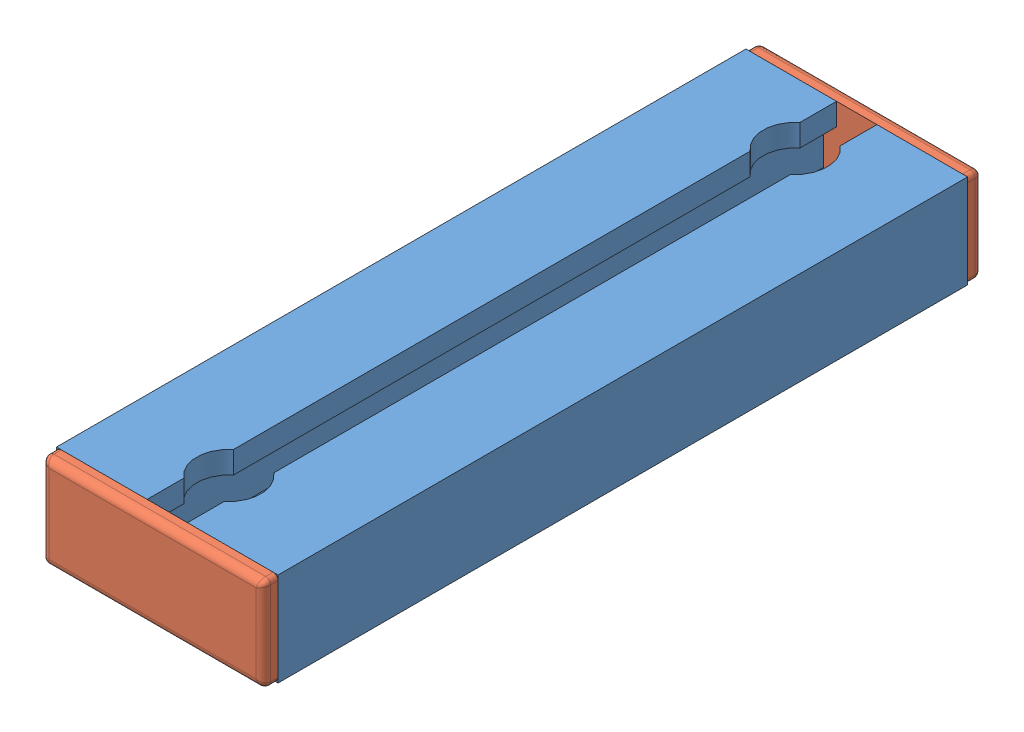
SolidWorks assembly 21.1730 FLOOR MOUNTING PLATE 45.SLDASM, configuration Default (file format 3800). Lengths in mm.
Overall size (45.01 19.01 146.01).
3 component instances, 2 part files, 6 mates.
Components (placement in the parent):
- 21.1730 FLOOR MOUNTING PLATE 45-1: 21.1730 FLOOR MOUNTING PLATE 45.SLDPRT [Default] at origin size (45 19 140)
- 22.1063_1 END CAP 45X19 GRAY-1: 22.1063_1 END CAP 45X19 GRAY.SLDPRT [Default] at (0 0 73) x (0 -1 0) z (0 0 -1) size (19.01 45.01 3)
- 22.1063_1 END CAP 45X19 GRAY-2: 22.1063_1 END CAP 45X19 GRAY.SLDPRT [Default] at (0 0 -73) x (0 1 0) z (0 0 1) size (19.01 45.01 3)
Mates (geometry in assembly coordinates):
- Coincident1: coincident: plane of 22.1063_1 END CAP 45X19 GRAY-1 through (0 0 70) normal (0 0 -1); plane of 21.1730 FLOOR MOUNTING PLATE 45-1 through (-22.5 9.5 70) normal (0 0 1)
- Coincident2: coincident: plane of 21.1730 FLOOR MOUNTING PLATE 45-1 through (-4.1 9.5 -70) normal (0 1 0); plane of 22.1063_1 END CAP 45X19 GRAY-1 through (22.5 9.5 73) normal (0 1 0)
- Coincident3: coincident aligned: plane of 21.1730 FLOOR MOUNTING PLATE 45-1 through (22.5 -9.5 -70) normal (1 0 0); plane of 22.1063_1 END CAP 45X19 GRAY-1 through (22.5 -9.5 73) normal (1 0 0)
- Coincident4: coincident: plane of 21.1730 FLOOR MOUNTING PLATE 45-1 through (-22.5 9.5 -70) normal (0 0 -1); plane of ? through (12.7292 0 -70) normal (0 0 1)
- Coincident5: coincident: plane of ? through (-9.7708 9.5 -73) normal (0 1 0); plane of 21.1730 FLOOR MOUNTING PLATE 45-1 through (-4.1 9.5 -70) normal (0 1 0)
- Coincident6: coincident aligned: plane of 21.1730 FLOOR MOUNTING PLATE 45-1 through (22.5 -9.5 -70) normal (1 0 0); plane of ? through (35.2292 9.5 -73) normal (1 0 0)
